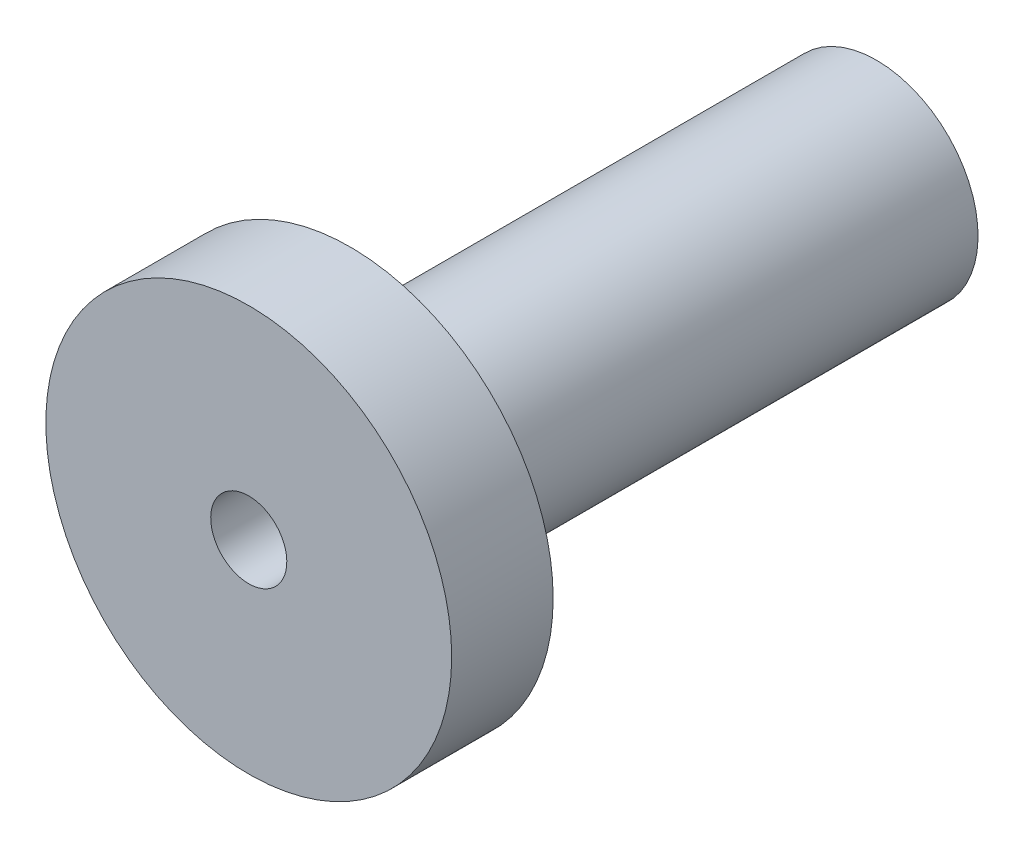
ISO-10303-21;
HEADER;
FILE_DESCRIPTION(('STEP AP214'),'2;1');
FILE_NAME('part.step','',(''),(''),'','','');
FILE_SCHEMA(('AUTOMOTIVE_DESIGN { 1 0 10303 214 1 1 1 1 }'));
ENDSEC;
DATA;
#1=APPLICATION_CONTEXT('core data for automotive mechanical design processes');
#2=APPLICATION_PROTOCOL_DEFINITION('international standard','automotive_design',2000,#1);
#3=PRODUCT_CONTEXT('',#1,'mechanical');
#4=PRODUCT('Part','Part','',(#3));
#5=PRODUCT_RELATED_PRODUCT_CATEGORY('part','',(#4));
#6=PRODUCT_DEFINITION_FORMATION('','',#4);
#7=PRODUCT_DEFINITION_CONTEXT('part definition',#1,'design');
#8=PRODUCT_DEFINITION('design','',#6,#7);
#9=PRODUCT_DEFINITION_SHAPE('','',#8);
#10=(LENGTH_UNIT() NAMED_UNIT(*) SI_UNIT(.MILLI.,.METRE.));
#11=(NAMED_UNIT(*) PLANE_ANGLE_UNIT() SI_UNIT($,.RADIAN.));
#12=(NAMED_UNIT(*) SI_UNIT($,.STERADIAN.) SOLID_ANGLE_UNIT());
#13=UNCERTAINTY_MEASURE_WITH_UNIT(LENGTH_MEASURE(1.E-05),#10,'distance_accuracy_value','');
#14=(GEOMETRIC_REPRESENTATION_CONTEXT(3) GLOBAL_UNCERTAINTY_ASSIGNED_CONTEXT((#13)) GLOBAL_UNIT_ASSIGNED_CONTEXT((#10,
#11,#12)) REPRESENTATION_CONTEXT('',''));
#15=CARTESIAN_POINT('',(0.,0.,0.));
#16=DIRECTION('',(0.,0.,1.));
#17=DIRECTION('',(1.,0.,0.));
#18=AXIS2_PLACEMENT_3D('',#15,#16,#17);
#19=CARTESIAN_POINT('',(0.,0.,-41.5));
#20=DIRECTION('',(0.,0.,-1.));
#21=DIRECTION('',(0.,1.,0.));
#22=AXIS2_PLACEMENT_3D('',#19,#20,#21);
#23=PLANE('',#22);
#24=CARTESIAN_POINT('',(0.,0.,-41.5));
#25=DIRECTION('',(0.,0.,-1.));
#26=DIRECTION('',(0.,1.,0.));
#27=AXIS2_PLACEMENT_3D('',#24,#25,#26);
#28=CIRCLE('',#27,8.);
#29=CARTESIAN_POINT('',(0.,8.,-41.5));
#30=VERTEX_POINT('',#29);
#31=EDGE_CURVE('E16',#30,#30,#28,.F.);
#32=ORIENTED_EDGE('',*,*,#31,.F.);
#33=EDGE_LOOP('',(#32));
#34=FACE_BOUND('',#33,.T.);
#35=ADVANCED_FACE('F12',(#34),#23,.T.);
#36=CARTESIAN_POINT('',(0.,0.,-41.5));
#37=DIRECTION('',(0.,0.,-1.));
#38=DIRECTION('',(0.,1.,0.));
#39=AXIS2_PLACEMENT_3D('',#36,#37,#38);
#40=CYLINDRICAL_SURFACE('',#39,8.);
#41=CARTESIAN_POINT('',(0.,0.,0.));
#42=DIRECTION('',(0.,0.,-1.));
#43=DIRECTION('',(0.,1.,0.));
#44=AXIS2_PLACEMENT_3D('',#41,#42,#43);
#45=CIRCLE('',#44,8.);
#46=CARTESIAN_POINT('',(0.,8.,0.));
#47=VERTEX_POINT('',#46);
#48=EDGE_CURVE('E32',#47,#47,#45,.F.);
#49=ORIENTED_EDGE('',*,*,#48,.F.);
#50=EDGE_LOOP('',(#49));
#51=FACE_BOUND('',#50,.T.);
#52=ORIENTED_EDGE('',*,*,#31,.T.);
#53=EDGE_LOOP('',(#52));
#54=FACE_BOUND('',#53,.T.);
#55=ADVANCED_FACE('F39',(#51,#54),#40,.T.);
#56=CARTESIAN_POINT('',(8.,0.,0.));
#57=DIRECTION('',(0.,0.,-1.));
#58=DIRECTION('',(0.,1.,0.));
#59=AXIS2_PLACEMENT_3D('',#56,#57,#58);
#60=PLANE('',#59);
#61=ORIENTED_EDGE('',*,*,#48,.T.);
#62=EDGE_LOOP('',(#61));
#63=FACE_BOUND('',#62,.T.);
#64=CARTESIAN_POINT('',(0.,0.,0.));
#65=DIRECTION('',(0.,0.,-1.));
#66=DIRECTION('',(1.,0.,0.));
#67=AXIS2_PLACEMENT_3D('',#64,#65,#66);
#68=CIRCLE('',#67,16.);
#69=CARTESIAN_POINT('',(16.,0.,0.));
#70=VERTEX_POINT('',#69);
#71=EDGE_CURVE('E30',#70,#70,#68,.F.);
#72=ORIENTED_EDGE('',*,*,#71,.F.);
#73=EDGE_LOOP('',(#72));
#74=FACE_BOUND('',#73,.T.);
#75=ADVANCED_FACE('F48',(#63,#74),#60,.T.);
#76=CARTESIAN_POINT('',(0.,0.,0.));
#77=DIRECTION('',(0.,0.,-1.));
#78=DIRECTION('',(1.,0.,0.));
#79=AXIS2_PLACEMENT_3D('',#76,#77,#78);
#80=CYLINDRICAL_SURFACE('',#79,16.);
#81=CARTESIAN_POINT('',(0.,0.,8.));
#82=DIRECTION('',(0.,0.,-1.));
#83=DIRECTION('',(1.,0.,0.));
#84=AXIS2_PLACEMENT_3D('',#81,#82,#83);
#85=CIRCLE('',#84,16.);
#86=CARTESIAN_POINT('',(16.,0.,8.));
#87=VERTEX_POINT('',#86);
#88=EDGE_CURVE('E25',#87,#87,#85,.F.);
#89=ORIENTED_EDGE('',*,*,#88,.F.);
#90=EDGE_LOOP('',(#89));
#91=FACE_BOUND('',#90,.T.);
#92=ORIENTED_EDGE('',*,*,#71,.T.);
#93=EDGE_LOOP('',(#92));
#94=FACE_BOUND('',#93,.T.);
#95=ADVANCED_FACE('F63',(#91,#94),#80,.T.);
#96=CARTESIAN_POINT('',(0.,0.,-29.5));
#97=DIRECTION('',(0.,0.,1.));
#98=DIRECTION('',(0.,-1.,0.));
#99=AXIS2_PLACEMENT_3D('',#96,#97,#98);
#100=PLANE('',#99);
#101=CARTESIAN_POINT('',(0.,0.,-29.5));
#102=DIRECTION('',(0.,0.,1.));
#103=DIRECTION('',(0.,-1.,0.));
#104=AXIS2_PLACEMENT_3D('',#101,#102,#103);
#105=CIRCLE('',#104,3.);
#106=CARTESIAN_POINT('',(0.,-3.,-29.5));
#107=VERTEX_POINT('',#106);
#108=EDGE_CURVE('E20',#107,#107,#105,.F.);
#109=ORIENTED_EDGE('',*,*,#108,.F.);
#110=EDGE_LOOP('',(#109));
#111=FACE_BOUND('',#110,.T.);
#112=ADVANCED_FACE('F57',(#111),#100,.T.);
#113=CARTESIAN_POINT('',(16.,0.,8.));
#114=DIRECTION('',(0.,0.,1.));
#115=DIRECTION('',(0.,-1.,0.));
#116=AXIS2_PLACEMENT_3D('',#113,#114,#115);
#117=PLANE('',#116);
#118=CARTESIAN_POINT('',(0.,0.,8.));
#119=DIRECTION('',(0.,0.,1.));
#120=DIRECTION('',(0.,-1.,0.));
#121=AXIS2_PLACEMENT_3D('',#118,#119,#120);
#122=CIRCLE('',#121,3.);
#123=CARTESIAN_POINT('',(0.,-3.,8.));
#124=VERTEX_POINT('',#123);
#125=EDGE_CURVE('E8',#124,#124,#122,.T.);
#126=ORIENTED_EDGE('',*,*,#125,.F.);
#127=EDGE_LOOP('',(#126));
#128=FACE_BOUND('',#127,.T.);
#129=ORIENTED_EDGE('',*,*,#88,.T.);
#130=EDGE_LOOP('',(#129));
#131=FACE_BOUND('',#130,.T.);
#132=ADVANCED_FACE('F52',(#128,#131),#117,.T.);
#133=CARTESIAN_POINT('',(0.,0.,-29.5));
#134=DIRECTION('',(0.,0.,1.));
#135=DIRECTION('',(0.,-1.,0.));
#136=AXIS2_PLACEMENT_3D('',#133,#134,#135);
#137=CYLINDRICAL_SURFACE('',#136,3.);
#138=ORIENTED_EDGE('',*,*,#125,.T.);
#139=EDGE_LOOP('',(#138));
#140=FACE_BOUND('',#139,.T.);
#141=ORIENTED_EDGE('',*,*,#108,.T.);
#142=EDGE_LOOP('',(#141));
#143=FACE_BOUND('',#142,.T.);
#144=ADVANCED_FACE('F14',(#140,#143),#137,.F.);
#145=CLOSED_SHELL('',(#35,#55,#75,#95,#112,#132,#144));
#146=MANIFOLD_SOLID_BREP('B1',#145);
#147=ADVANCED_BREP_SHAPE_REPRESENTATION('',(#18,#146),#14);
#148=SHAPE_DEFINITION_REPRESENTATION(#9,#147);
ENDSEC;
END-ISO-10303-21;
